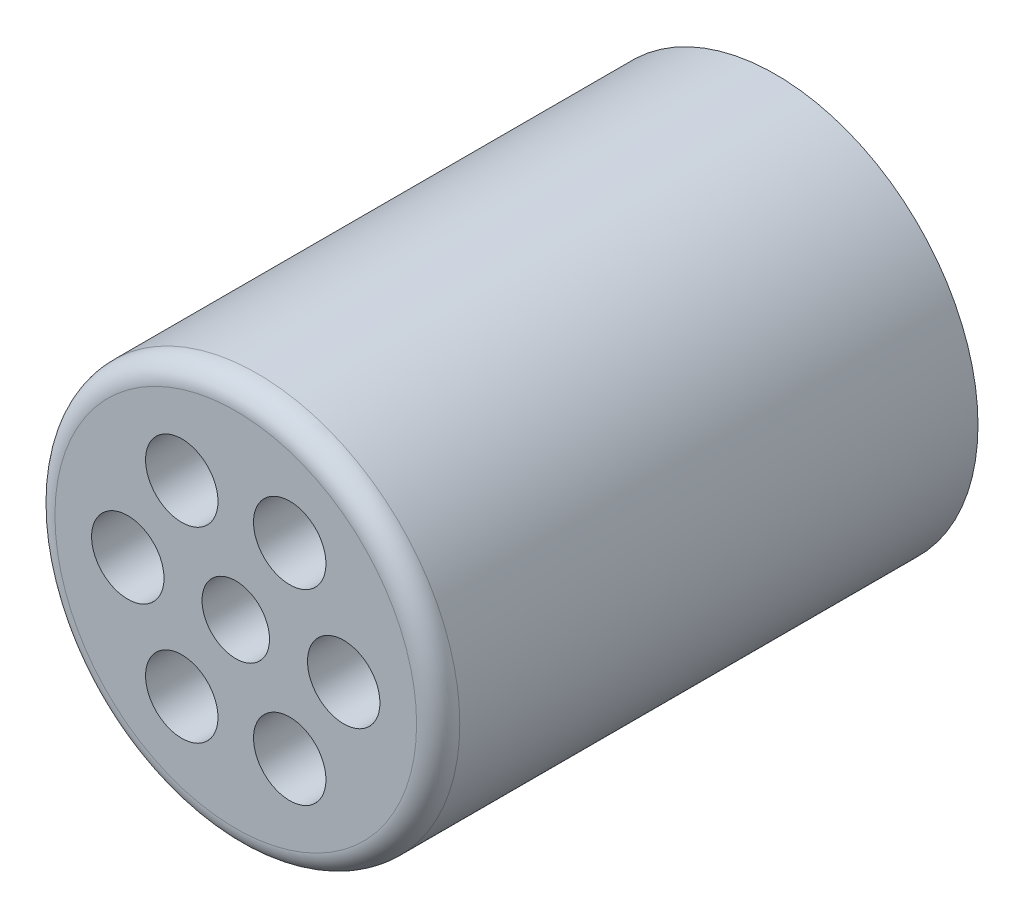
ISO-10303-21;
HEADER;
FILE_DESCRIPTION(('STEP AP214'),'2;1');
FILE_NAME('part.step','',(''),(''),'','','');
FILE_SCHEMA(('AUTOMOTIVE_DESIGN { 1 0 10303 214 1 1 1 1 }'));
ENDSEC;
DATA;
#1=APPLICATION_CONTEXT('core data for automotive mechanical design processes');
#2=APPLICATION_PROTOCOL_DEFINITION('international standard','automotive_design',2000,#1);
#3=PRODUCT_CONTEXT('',#1,'mechanical');
#4=PRODUCT('Part','Part','',(#3));
#5=PRODUCT_RELATED_PRODUCT_CATEGORY('part','',(#4));
#6=PRODUCT_DEFINITION_FORMATION('','',#4);
#7=PRODUCT_DEFINITION_CONTEXT('part definition',#1,'design');
#8=PRODUCT_DEFINITION('design','',#6,#7);
#9=PRODUCT_DEFINITION_SHAPE('','',#8);
#10=(LENGTH_UNIT() NAMED_UNIT(*) SI_UNIT(.MILLI.,.METRE.));
#11=(NAMED_UNIT(*) PLANE_ANGLE_UNIT() SI_UNIT($,.RADIAN.));
#12=(NAMED_UNIT(*) SI_UNIT($,.STERADIAN.) SOLID_ANGLE_UNIT());
#13=UNCERTAINTY_MEASURE_WITH_UNIT(LENGTH_MEASURE(1.E-05),#10,'distance_accuracy_value','');
#14=(GEOMETRIC_REPRESENTATION_CONTEXT(3) GLOBAL_UNCERTAINTY_ASSIGNED_CONTEXT((#13)) GLOBAL_UNIT_ASSIGNED_CONTEXT((#10,
#11,#12)) REPRESENTATION_CONTEXT('',''));
#15=CARTESIAN_POINT('',(0.,0.,0.));
#16=DIRECTION('',(0.,0.,1.));
#17=DIRECTION('',(1.,0.,0.));
#18=AXIS2_PLACEMENT_3D('',#15,#16,#17);
#19=CARTESIAN_POINT('',(0.,0.,12.7));
#20=DIRECTION('',(0.,0.,-1.));
#21=DIRECTION('',(-1.,0.,0.));
#22=AXIS2_PLACEMENT_3D('',#19,#20,#21);
#23=CYLINDRICAL_SURFACE('',#22,4.7625);
#24=CARTESIAN_POINT('',(0.,0.,12.192));
#25=DIRECTION('',(0.,0.,1.));
#26=DIRECTION('',(1.,0.,0.));
#27=AXIS2_PLACEMENT_3D('',#24,#25,#26);
#28=CIRCLE('',#27,4.7625);
#29=CARTESIAN_POINT('',(4.7625,0.,12.192));
#30=VERTEX_POINT('',#29);
#31=EDGE_CURVE('E10',#30,#30,#28,.F.);
#32=ORIENTED_EDGE('',*,*,#31,.T.);
#33=EDGE_LOOP('',(#32));
#34=FACE_BOUND('',#33,.T.);
#35=CARTESIAN_POINT('',(0.,0.,0.));
#36=DIRECTION('',(0.,0.,1.));
#37=DIRECTION('',(1.,0.,0.));
#38=AXIS2_PLACEMENT_3D('',#35,#36,#37);
#39=CIRCLE('',#38,4.7625);
#40=CARTESIAN_POINT('',(4.7625,0.,0.));
#41=VERTEX_POINT('',#40);
#42=EDGE_CURVE('E39',#41,#41,#39,.T.);
#43=ORIENTED_EDGE('',*,*,#42,.T.);
#44=EDGE_LOOP('',(#43));
#45=FACE_BOUND('',#44,.T.);
#46=ADVANCED_FACE('F29',(#34,#45),#23,.T.);
#47=CARTESIAN_POINT('',(0.,0.,12.7));
#48=DIRECTION('',(0.,0.,1.));
#49=DIRECTION('',(1.,0.,0.));
#50=AXIS2_PLACEMENT_3D('',#47,#48,#49);
#51=PLANE('',#50);
#52=CARTESIAN_POINT('',(0.,0.,12.7));
#53=DIRECTION('',(0.,0.,1.));
#54=DIRECTION('',(1.,0.,0.));
#55=AXIS2_PLACEMENT_3D('',#52,#53,#54);
#56=CIRCLE('',#55,4.2545);
#57=CARTESIAN_POINT('',(4.2545,0.,12.7));
#58=VERTEX_POINT('',#57);
#59=EDGE_CURVE('E35',#58,#58,#56,.T.);
#60=ORIENTED_EDGE('',*,*,#59,.T.);
#61=EDGE_LOOP('',(#60));
#62=FACE_BOUND('',#61,.T.);
#63=CARTESIAN_POINT('',(1.27,2.19970452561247,12.7));
#64=DIRECTION('',(0.,0.,1.));
#65=DIRECTION('',(1.,0.,0.));
#66=AXIS2_PLACEMENT_3D('',#63,#64,#65);
#67=CIRCLE('',#66,0.852064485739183);
#68=CARTESIAN_POINT('',(2.12206448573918,2.19970452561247,12.7));
#69=VERTEX_POINT('',#68);
#70=EDGE_CURVE('E84',#69,#69,#67,.T.);
#71=ORIENTED_EDGE('',*,*,#70,.F.);
#72=EDGE_LOOP('',(#71));
#73=FACE_BOUND('',#72,.T.);
#74=CARTESIAN_POINT('',(-1.27,2.19970452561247,12.7));
#75=DIRECTION('',(0.,0.,1.));
#76=DIRECTION('',(1.,0.,0.));
#77=AXIS2_PLACEMENT_3D('',#74,#75,#76);
#78=CIRCLE('',#77,0.852064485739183);
#79=CARTESIAN_POINT('',(-0.417935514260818,2.19970452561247,12.7));
#80=VERTEX_POINT('',#79);
#81=EDGE_CURVE('E78',#80,#80,#78,.T.);
#82=ORIENTED_EDGE('',*,*,#81,.F.);
#83=EDGE_LOOP('',(#82));
#84=FACE_BOUND('',#83,.T.);
#85=CARTESIAN_POINT('',(-2.54,0.,12.7));
#86=DIRECTION('',(0.,0.,1.));
#87=DIRECTION('',(1.,0.,0.));
#88=AXIS2_PLACEMENT_3D('',#85,#86,#87);
#89=CIRCLE('',#88,0.852064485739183);
#90=CARTESIAN_POINT('',(-1.68793551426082,0.,12.7));
#91=VERTEX_POINT('',#90);
#92=EDGE_CURVE('E72',#91,#91,#89,.T.);
#93=ORIENTED_EDGE('',*,*,#92,.F.);
#94=EDGE_LOOP('',(#93));
#95=FACE_BOUND('',#94,.T.);
#96=CARTESIAN_POINT('',(-1.27,-2.19970452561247,12.7));
#97=DIRECTION('',(0.,0.,1.));
#98=DIRECTION('',(1.,0.,0.));
#99=AXIS2_PLACEMENT_3D('',#96,#97,#98);
#100=CIRCLE('',#99,0.852064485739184);
#101=CARTESIAN_POINT('',(-0.417935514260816,-2.19970452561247,12.7));
#102=VERTEX_POINT('',#101);
#103=EDGE_CURVE('E66',#102,#102,#100,.T.);
#104=ORIENTED_EDGE('',*,*,#103,.F.);
#105=EDGE_LOOP('',(#104));
#106=FACE_BOUND('',#105,.T.);
#107=CARTESIAN_POINT('',(1.27,-2.19970452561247,12.7));
#108=DIRECTION('',(0.,0.,1.));
#109=DIRECTION('',(1.,0.,0.));
#110=AXIS2_PLACEMENT_3D('',#107,#108,#109);
#111=CIRCLE('',#110,0.852064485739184);
#112=CARTESIAN_POINT('',(2.12206448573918,-2.19970452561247,12.7));
#113=VERTEX_POINT('',#112);
#114=EDGE_CURVE('E60',#113,#113,#111,.T.);
#115=ORIENTED_EDGE('',*,*,#114,.F.);
#116=EDGE_LOOP('',(#115));
#117=FACE_BOUND('',#116,.T.);
#118=CARTESIAN_POINT('',(2.54,0.,12.7));
#119=DIRECTION('',(0.,0.,1.));
#120=DIRECTION('',(1.,0.,0.));
#121=AXIS2_PLACEMENT_3D('',#118,#119,#120);
#122=CIRCLE('',#121,0.852064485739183);
#123=CARTESIAN_POINT('',(3.39206448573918,0.,12.7));
#124=VERTEX_POINT('',#123);
#125=EDGE_CURVE('E54',#124,#124,#122,.T.);
#126=ORIENTED_EDGE('',*,*,#125,.F.);
#127=EDGE_LOOP('',(#126));
#128=FACE_BOUND('',#127,.T.);
#129=CARTESIAN_POINT('',(0.,0.,12.7));
#130=DIRECTION('',(0.,0.,1.));
#131=DIRECTION('',(1.,0.,0.));
#132=AXIS2_PLACEMENT_3D('',#129,#130,#131);
#133=CIRCLE('',#132,0.79375);
#134=CARTESIAN_POINT('',(0.79375,0.,12.7));
#135=VERTEX_POINT('',#134);
#136=EDGE_CURVE('E48',#135,#135,#133,.T.);
#137=ORIENTED_EDGE('',*,*,#136,.F.);
#138=EDGE_LOOP('',(#137));
#139=FACE_BOUND('',#138,.T.);
#140=ADVANCED_FACE('F90',(#62,#73,#84,#95,#106,#117,#128,#139),#51,.T.);
#141=CARTESIAN_POINT('',(0.,0.,0.));
#142=DIRECTION('',(0.,0.,1.));
#143=DIRECTION('',(1.,0.,0.));
#144=AXIS2_PLACEMENT_3D('',#141,#142,#143);
#145=PLANE('',#144);
#146=ORIENTED_EDGE('',*,*,#42,.F.);
#147=EDGE_LOOP('',(#146));
#148=FACE_BOUND('',#147,.T.);
#149=ADVANCED_FACE('F93',(#148),#145,.F.);
#150=CARTESIAN_POINT('',(0.,0.,6.35));
#151=DIRECTION('',(0.,0.,1.));
#152=DIRECTION('',(1.,0.,0.));
#153=AXIS2_PLACEMENT_3D('',#150,#151,#152);
#154=CYLINDRICAL_SURFACE('',#153,0.79375);
#155=CARTESIAN_POINT('',(0.,0.,6.35));
#156=DIRECTION('',(0.,0.,1.));
#157=DIRECTION('',(1.,0.,0.));
#158=AXIS2_PLACEMENT_3D('',#155,#156,#157);
#159=CIRCLE('',#158,0.79375);
#160=CARTESIAN_POINT('',(0.79375,0.,6.35));
#161=VERTEX_POINT('',#160);
#162=EDGE_CURVE('E43',#161,#161,#159,.T.);
#163=ORIENTED_EDGE('',*,*,#162,.F.);
#164=EDGE_LOOP('',(#163));
#165=FACE_BOUND('',#164,.T.);
#166=ORIENTED_EDGE('',*,*,#136,.T.);
#167=EDGE_LOOP('',(#166));
#168=FACE_BOUND('',#167,.T.);
#169=ADVANCED_FACE('F106',(#165,#168),#154,.F.);
#170=CARTESIAN_POINT('',(0.,0.,6.35));
#171=DIRECTION('',(0.,0.,1.));
#172=DIRECTION('',(1.,0.,0.));
#173=AXIS2_PLACEMENT_3D('',#170,#171,#172);
#174=PLANE('',#173);
#175=ORIENTED_EDGE('',*,*,#162,.T.);
#176=EDGE_LOOP('',(#175));
#177=FACE_BOUND('',#176,.T.);
#178=ADVANCED_FACE('F108',(#177),#174,.T.);
#179=CARTESIAN_POINT('',(2.54,0.,6.35));
#180=DIRECTION('',(0.,0.,1.));
#181=DIRECTION('',(1.,0.,0.));
#182=AXIS2_PLACEMENT_3D('',#179,#180,#181);
#183=CYLINDRICAL_SURFACE('',#182,0.852064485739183);
#184=CARTESIAN_POINT('',(2.54,0.,6.35));
#185=DIRECTION('',(0.,0.,1.));
#186=DIRECTION('',(1.,0.,0.));
#187=AXIS2_PLACEMENT_3D('',#184,#185,#186);
#188=CIRCLE('',#187,0.852064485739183);
#189=CARTESIAN_POINT('',(3.39206448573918,0.,6.35));
#190=VERTEX_POINT('',#189);
#191=EDGE_CURVE('E51',#190,#190,#188,.T.);
#192=ORIENTED_EDGE('',*,*,#191,.F.);
#193=EDGE_LOOP('',(#192));
#194=FACE_BOUND('',#193,.T.);
#195=ORIENTED_EDGE('',*,*,#125,.T.);
#196=EDGE_LOOP('',(#195));
#197=FACE_BOUND('',#196,.T.);
#198=ADVANCED_FACE('F115',(#194,#197),#183,.F.);
#199=CARTESIAN_POINT('',(2.54,0.,6.35));
#200=DIRECTION('',(0.,0.,1.));
#201=DIRECTION('',(1.,0.,0.));
#202=AXIS2_PLACEMENT_3D('',#199,#200,#201);
#203=PLANE('',#202);
#204=ORIENTED_EDGE('',*,*,#191,.T.);
#205=EDGE_LOOP('',(#204));
#206=FACE_BOUND('',#205,.T.);
#207=ADVANCED_FACE('F155',(#206),#203,.T.);
#208=CARTESIAN_POINT('',(1.27,-2.19970452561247,6.35));
#209=DIRECTION('',(0.,0.,1.));
#210=DIRECTION('',(1.,0.,0.));
#211=AXIS2_PLACEMENT_3D('',#208,#209,#210);
#212=CYLINDRICAL_SURFACE('',#211,0.852064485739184);
#213=CARTESIAN_POINT('',(1.27,-2.19970452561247,6.35));
#214=DIRECTION('',(0.,0.,1.));
#215=DIRECTION('',(1.,0.,0.));
#216=AXIS2_PLACEMENT_3D('',#213,#214,#215);
#217=CIRCLE('',#216,0.852064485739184);
#218=CARTESIAN_POINT('',(2.12206448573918,-2.19970452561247,6.35));
#219=VERTEX_POINT('',#218);
#220=EDGE_CURVE('E57',#219,#219,#217,.T.);
#221=ORIENTED_EDGE('',*,*,#220,.F.);
#222=EDGE_LOOP('',(#221));
#223=FACE_BOUND('',#222,.T.);
#224=ORIENTED_EDGE('',*,*,#114,.T.);
#225=EDGE_LOOP('',(#224));
#226=FACE_BOUND('',#225,.T.);
#227=ADVANCED_FACE('F165',(#223,#226),#212,.F.);
#228=CARTESIAN_POINT('',(1.27,-2.19970452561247,6.35));
#229=DIRECTION('',(0.,0.,1.));
#230=DIRECTION('',(1.,0.,0.));
#231=AXIS2_PLACEMENT_3D('',#228,#229,#230);
#232=PLANE('',#231);
#233=ORIENTED_EDGE('',*,*,#220,.T.);
#234=EDGE_LOOP('',(#233));
#235=FACE_BOUND('',#234,.T.);
#236=ADVANCED_FACE('F175',(#235),#232,.T.);
#237=CARTESIAN_POINT('',(-1.27,-2.19970452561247,6.35));
#238=DIRECTION('',(0.,0.,1.));
#239=DIRECTION('',(1.,0.,0.));
#240=AXIS2_PLACEMENT_3D('',#237,#238,#239);
#241=CYLINDRICAL_SURFACE('',#240,0.852064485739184);
#242=CARTESIAN_POINT('',(-1.27,-2.19970452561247,6.35));
#243=DIRECTION('',(0.,0.,1.));
#244=DIRECTION('',(1.,0.,0.));
#245=AXIS2_PLACEMENT_3D('',#242,#243,#244);
#246=CIRCLE('',#245,0.852064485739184);
#247=CARTESIAN_POINT('',(-0.417935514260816,-2.19970452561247,6.35));
#248=VERTEX_POINT('',#247);
#249=EDGE_CURVE('E63',#248,#248,#246,.T.);
#250=ORIENTED_EDGE('',*,*,#249,.F.);
#251=EDGE_LOOP('',(#250));
#252=FACE_BOUND('',#251,.T.);
#253=ORIENTED_EDGE('',*,*,#103,.T.);
#254=EDGE_LOOP('',(#253));
#255=FACE_BOUND('',#254,.T.);
#256=ADVANCED_FACE('F185',(#252,#255),#241,.F.);
#257=CARTESIAN_POINT('',(-1.27,-2.19970452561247,6.35));
#258=DIRECTION('',(0.,0.,1.));
#259=DIRECTION('',(1.,0.,0.));
#260=AXIS2_PLACEMENT_3D('',#257,#258,#259);
#261=PLANE('',#260);
#262=ORIENTED_EDGE('',*,*,#249,.T.);
#263=EDGE_LOOP('',(#262));
#264=FACE_BOUND('',#263,.T.);
#265=ADVANCED_FACE('F195',(#264),#261,.T.);
#266=CARTESIAN_POINT('',(-2.54,0.,6.35));
#267=DIRECTION('',(0.,0.,1.));
#268=DIRECTION('',(1.,0.,0.));
#269=AXIS2_PLACEMENT_3D('',#266,#267,#268);
#270=CYLINDRICAL_SURFACE('',#269,0.852064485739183);
#271=CARTESIAN_POINT('',(-2.54,0.,6.35));
#272=DIRECTION('',(0.,0.,1.));
#273=DIRECTION('',(1.,0.,0.));
#274=AXIS2_PLACEMENT_3D('',#271,#272,#273);
#275=CIRCLE('',#274,0.852064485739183);
#276=CARTESIAN_POINT('',(-1.68793551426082,0.,6.35));
#277=VERTEX_POINT('',#276);
#278=EDGE_CURVE('E69',#277,#277,#275,.T.);
#279=ORIENTED_EDGE('',*,*,#278,.F.);
#280=EDGE_LOOP('',(#279));
#281=FACE_BOUND('',#280,.T.);
#282=ORIENTED_EDGE('',*,*,#92,.T.);
#283=EDGE_LOOP('',(#282));
#284=FACE_BOUND('',#283,.T.);
#285=ADVANCED_FACE('F205',(#281,#284),#270,.F.);
#286=CARTESIAN_POINT('',(-2.54,0.,6.35));
#287=DIRECTION('',(0.,0.,1.));
#288=DIRECTION('',(1.,0.,0.));
#289=AXIS2_PLACEMENT_3D('',#286,#287,#288);
#290=PLANE('',#289);
#291=ORIENTED_EDGE('',*,*,#278,.T.);
#292=EDGE_LOOP('',(#291));
#293=FACE_BOUND('',#292,.T.);
#294=ADVANCED_FACE('F215',(#293),#290,.T.);
#295=CARTESIAN_POINT('',(-1.27,2.19970452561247,6.35));
#296=DIRECTION('',(0.,0.,1.));
#297=DIRECTION('',(1.,0.,0.));
#298=AXIS2_PLACEMENT_3D('',#295,#296,#297);
#299=CYLINDRICAL_SURFACE('',#298,0.852064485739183);
#300=CARTESIAN_POINT('',(-1.27,2.19970452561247,6.35));
#301=DIRECTION('',(0.,0.,1.));
#302=DIRECTION('',(1.,0.,0.));
#303=AXIS2_PLACEMENT_3D('',#300,#301,#302);
#304=CIRCLE('',#303,0.852064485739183);
#305=CARTESIAN_POINT('',(-0.417935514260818,2.19970452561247,6.35));
#306=VERTEX_POINT('',#305);
#307=EDGE_CURVE('E75',#306,#306,#304,.T.);
#308=ORIENTED_EDGE('',*,*,#307,.F.);
#309=EDGE_LOOP('',(#308));
#310=FACE_BOUND('',#309,.T.);
#311=ORIENTED_EDGE('',*,*,#81,.T.);
#312=EDGE_LOOP('',(#311));
#313=FACE_BOUND('',#312,.T.);
#314=ADVANCED_FACE('F225',(#310,#313),#299,.F.);
#315=CARTESIAN_POINT('',(-1.27,2.19970452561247,6.35));
#316=DIRECTION('',(0.,0.,1.));
#317=DIRECTION('',(1.,0.,0.));
#318=AXIS2_PLACEMENT_3D('',#315,#316,#317);
#319=PLANE('',#318);
#320=ORIENTED_EDGE('',*,*,#307,.T.);
#321=EDGE_LOOP('',(#320));
#322=FACE_BOUND('',#321,.T.);
#323=ADVANCED_FACE('F235',(#322),#319,.T.);
#324=CARTESIAN_POINT('',(1.27,2.19970452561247,6.35));
#325=DIRECTION('',(0.,0.,1.));
#326=DIRECTION('',(1.,0.,0.));
#327=AXIS2_PLACEMENT_3D('',#324,#325,#326);
#328=CYLINDRICAL_SURFACE('',#327,0.852064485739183);
#329=CARTESIAN_POINT('',(1.27,2.19970452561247,6.35));
#330=DIRECTION('',(0.,0.,1.));
#331=DIRECTION('',(1.,0.,0.));
#332=AXIS2_PLACEMENT_3D('',#329,#330,#331);
#333=CIRCLE('',#332,0.852064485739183);
#334=CARTESIAN_POINT('',(2.12206448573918,2.19970452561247,6.35));
#335=VERTEX_POINT('',#334);
#336=EDGE_CURVE('E81',#335,#335,#333,.T.);
#337=ORIENTED_EDGE('',*,*,#336,.F.);
#338=EDGE_LOOP('',(#337));
#339=FACE_BOUND('',#338,.T.);
#340=ORIENTED_EDGE('',*,*,#70,.T.);
#341=EDGE_LOOP('',(#340));
#342=FACE_BOUND('',#341,.T.);
#343=ADVANCED_FACE('F88',(#339,#342),#328,.F.);
#344=CARTESIAN_POINT('',(1.27,2.19970452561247,6.35));
#345=DIRECTION('',(0.,0.,1.));
#346=DIRECTION('',(1.,0.,0.));
#347=AXIS2_PLACEMENT_3D('',#344,#345,#346);
#348=PLANE('',#347);
#349=ORIENTED_EDGE('',*,*,#336,.T.);
#350=EDGE_LOOP('',(#349));
#351=FACE_BOUND('',#350,.T.);
#352=ADVANCED_FACE('F253',(#351),#348,.T.);
#353=CARTESIAN_POINT('',(0.,0.,12.192));
#354=DIRECTION('',(0.,0.,1.));
#355=DIRECTION('',(1.,0.,0.));
#356=AXIS2_PLACEMENT_3D('',#353,#354,#355);
#357=TOROIDAL_SURFACE('',#356,4.2545,0.508);
#358=ORIENTED_EDGE('',*,*,#31,.F.);
#359=EDGE_LOOP('',(#358));
#360=FACE_BOUND('',#359,.T.);
#361=ORIENTED_EDGE('',*,*,#59,.F.);
#362=EDGE_LOOP('',(#361));
#363=FACE_BOUND('',#362,.T.);
#364=ADVANCED_FACE('F262',(#360,#363),#357,.T.);
#365=CLOSED_SHELL('',(#46,#140,#149,#169,#178,#198,#207,#227,#236,#256,#265,#285,#294,#314,#323,
#343,#352,#364));
#366=MANIFOLD_SOLID_BREP('B2',#365);
#367=ADVANCED_BREP_SHAPE_REPRESENTATION('',(#18,#366),#14);
#368=SHAPE_DEFINITION_REPRESENTATION(#9,#367);
ENDSEC;
END-ISO-10303-21;
